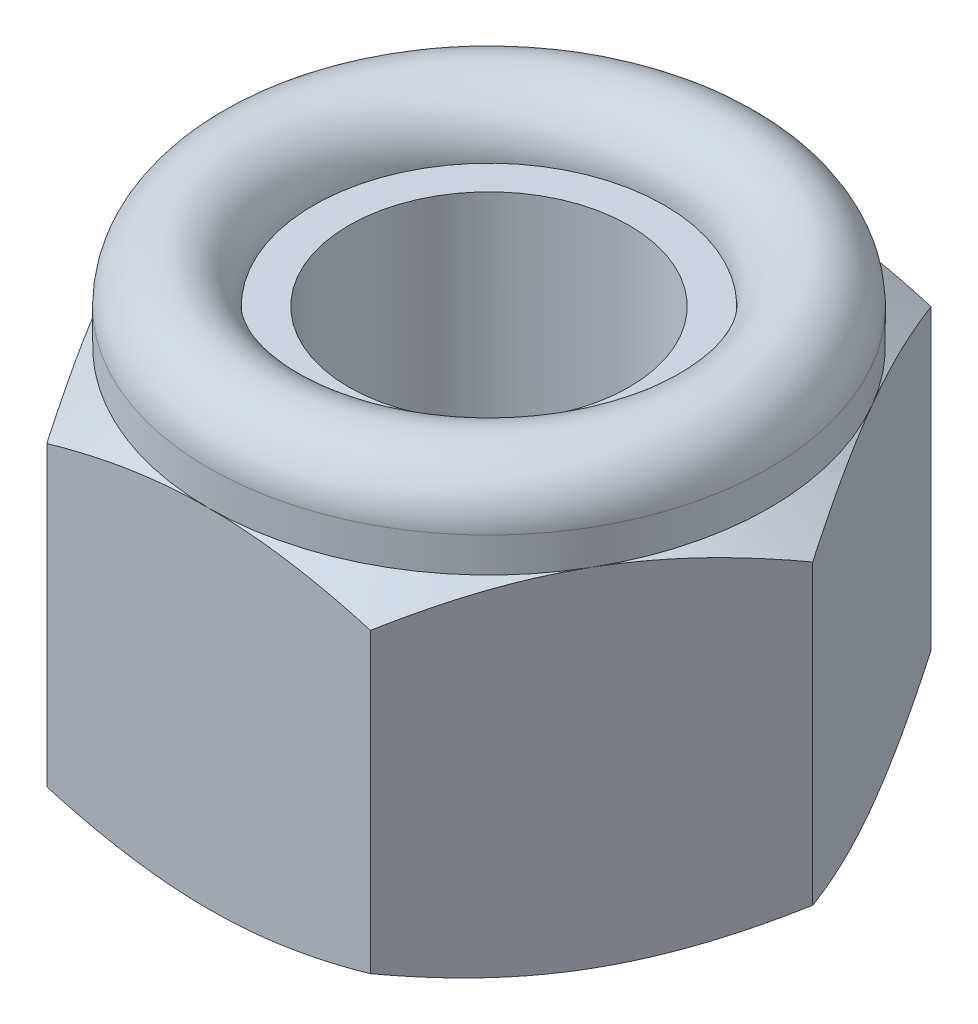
from build123d import *

# Parameters (mm, degrees)
ESQUISSE2_OUTSIDE_W      = 31.492
ESQUISSE2_OUTSIDE_H      = 31.492
HEXAGONE_DEPTH           = 21.242529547
CHANFREIN_INF_RIEUR_SIZE = 1


with BuildPart() as part:
    # Esquisse1 → Base (revolve)
    with BuildSketch(Plane.XY, mode=Mode.PRIVATE) as base_sk:
        with BuildLine():
            Line((5, 10.9), (6.5, 10.9))
            Line((6.5, 10.9), (6.5, 8.669872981))
            Line((6.5, 8.669872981), (4, 8))
            Line((4, 8), (4, 0))
            Line((4, 0), (8.000000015, 0))
            Line((8.000000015, 0), (11.313708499, 1.91317052))
            Line((11.313708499, 1.91317052), (11.313708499, 8))
            Line((11.313708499, 8), (8, 9.913170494))
            Line((8, 9.913170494), (8, 10.9))
            ThreePointArc((8, 10.9), (6.5, 12.4), (5, 10.9))
        make_face()
    revolve(base_sk.sketch.rotate(Axis((0, 0, 0), (0, 1, 0)), 90), axis=Axis((0, 0, 0), (0, 1, 0)))

    # Esquisse2 outside → Hexagone (cut, through all)
    with BuildSketch(Plane(origin=(0, 0, 0), x_dir=(1, 0, 0), z_dir=(0, 1, 0))):
        Rectangle(ESQUISSE2_OUTSIDE_W, ESQUISSE2_OUTSIDE_H)
        Polygon((-4.618802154, 8), (4.618802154, 8), (9.237604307, 0), (4.618802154, -8), (-4.618802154, -8), (-9.237604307, 0), align=None, mode=Mode.SUBTRACT)
    extrude(amount=HEXAGONE_DEPTH, mode=Mode.SUBTRACT)

    # Chanfrein inf_rieur
    chanfrein_inf_rieur_edges = [part.edges().sort_by_distance(p)[0] for p in [
        (0, 0, 4),
    ]]
    chamfer(chanfrein_inf_rieur_edges, length=CHANFREIN_INF_RIEUR_SIZE)

    # Esquisse4 → Bague frein (revolve)
    with BuildSketch(Plane.XY, mode=Mode.PRIVATE) as bague_frein_sk:
        Polygon((6.5, 10.9), (4, 10.9), (4, 8), (6.5, 8.669872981), align=None)
    revolve(bague_frein_sk.sketch.rotate(Axis((0, 9.913170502, 0), (0, -1, 0)), 270), axis=Axis((0, 9.913170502, 0), (0, -1, 0)))


solid = part.part
